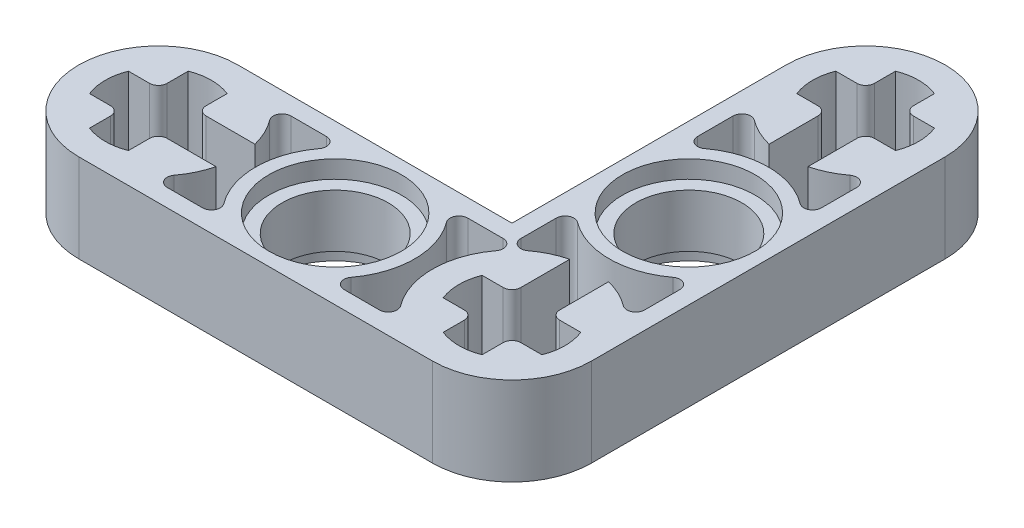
from build123d import *

# Parameters (mm, degrees)
BOSS_EXTRUDE1_DEPTH      = 2
BOSS_EXTRUDE1_DEPTH_BACK = 2
SKETCH2_R                = 2.4
SKETCH3_R                = 3
CUT_EXTRUDE1_DEPTH       = 0.8


with BuildPart() as part:
    # Sketch2 → Boss-Extrude1 (new, two sides: drawn at the far end of the back side and taken through both)
    with BuildSketch(Plane(origin=(0, 0, 0), x_dir=(1, 0, 0), z_dir=(0, 1, 0)).offset(-BOSS_EXTRUDE1_DEPTH_BACK)):
        with BuildLine():
            Line((-16, 3.6), (-3.6, 3.6))
            Line((-3.6, 3.6), (-3.6, 16))
            ThreePointArc((-3.6, 16), (0, 19.6), (3.6, 16))
            Line((3.6, 16), (3.6, 0))
            ThreePointArc((3.6, 0), (2.545584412, -2.545584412), (0, -3.6))
            Line((0, -3.6), (-16, -3.6))
            ThreePointArc((-16, -3.6), (-19.6, 0), (-16, 3.6))
        make_face()
        with Locations(Location((0, 8, 0), (0, 0, 270))):
            Circle(SKETCH2_R, mode=Mode.SUBTRACT)
        with Locations(Location((-8, 0, 0), (0, 0, 270))):
            Circle(SKETCH2_R, mode=Mode.SUBTRACT)
        with BuildLine():
            Line((-0.88, 2.232845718), (-0.88, 1.28))
            ThreePointArc((-0.88, 1.28), (-0.997157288, 0.997157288), (-1.28, 0.88))
            Line((-1.28, 0.88), (-2.232845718, 0.88))
            ThreePointArc((-2.232845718, 0.88), (-2.4, 0), (-2.232845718, -0.88))
            Line((-2.232845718, -0.88), (-1.28, -0.88))
            ThreePointArc((-1.28, -0.88), (-0.997157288, -0.997157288), (-0.88, -1.28))
            Line((-0.88, -1.28), (-0.88, -2.232845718))
            ThreePointArc((-0.88, -2.232845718), (0, -2.4), (0.88, -2.232845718))
            Line((0.88, -2.232845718), (0.88, -1.28))
            ThreePointArc((0.88, -1.28), (0.997157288, -0.997157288), (1.28, -0.88))
            Line((1.28, -0.88), (2.232845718, -0.88))
            ThreePointArc((2.232845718, -0.88), (2.4, 0), (2.232845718, 0.88))
            Line((2.232845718, 0.88), (1.28, 0.88))
            ThreePointArc((1.28, 0.88), (0.997157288, 0.997157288), (0.88, 1.28))
            Line((0.88, 1.28), (0.88, 2.232845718))
            Line((0.88, 2.232845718), (0.88, 3.490787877))
            ThreePointArc((0.88, 3.490787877), (1.550375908, 3.24905133), (2.16, 2.88))
            ThreePointArc((2.16, 2.88), (2.578885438, 2.842229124), (2.8, 3.2))
            Line((2.8, 3.2), (2.8, 4.8))
            ThreePointArc((2.8, 4.8), (2.578885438, 5.157770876), (2.16, 5.12))
            ThreePointArc((2.16, 5.12), (0, 4.4), (-2.16, 5.12))
            ThreePointArc((-2.16, 5.12), (-2.578885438, 5.157770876), (-2.8, 4.8))
            Line((-2.8, 4.8), (-2.8, 3.2))
            ThreePointArc((-2.8, 3.2), (-2.578885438, 2.842229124), (-2.16, 2.88))
            ThreePointArc((-2.16, 2.88), (-1.550375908, 3.24905133), (-0.88, 3.490787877))
            Line((-0.88, 3.490787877), (-0.88, 2.232845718))
        make_face(mode=Mode.SUBTRACT)
        with BuildLine():
            Line((-18.232845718, -0.88), (-17.28, -0.88))
            ThreePointArc((-17.28, -0.88), (-16.997157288, -0.997157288), (-16.88, -1.28))
            Line((-16.88, -1.28), (-16.88, -2.232845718))
            ThreePointArc((-16.88, -2.232845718), (-16, -2.4), (-15.12, -2.232845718))
            Line((-15.12, -2.232845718), (-15.12, -1.28))
            ThreePointArc((-15.12, -1.28), (-15.002842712, -0.997157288), (-14.72, -0.88))
            Line((-14.72, -0.88), (-13.767154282, -0.88))
            Line((-13.767154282, -0.88), (-12.509212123, -0.88))
            ThreePointArc((-12.509212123, -0.88), (-12.75094867, -1.550375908), (-13.12, -2.16))
            ThreePointArc((-13.12, -2.16), (-13.157770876, -2.578885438), (-12.8, -2.8))
            Line((-12.8, -2.8), (-11.2, -2.8))
            ThreePointArc((-11.2, -2.8), (-10.842229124, -2.578885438), (-10.88, -2.16))
            ThreePointArc((-10.88, -2.16), (-11.6, 0), (-10.88, 2.16))
            ThreePointArc((-10.88, 2.16), (-10.842229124, 2.578885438), (-11.2, 2.8))
            Line((-11.2, 2.8), (-12.8, 2.8))
            ThreePointArc((-12.8, 2.8), (-13.157770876, 2.578885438), (-13.12, 2.16))
            ThreePointArc((-13.12, 2.16), (-12.75094867, 1.550375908), (-12.509212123, 0.88))
            Line((-12.509212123, 0.88), (-13.767154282, 0.88))
            Line((-13.767154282, 0.88), (-14.72, 0.88))
            ThreePointArc((-14.72, 0.88), (-15.002842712, 0.997157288), (-15.12, 1.28))
            Line((-15.12, 1.28), (-15.12, 2.232845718))
            ThreePointArc((-15.12, 2.232845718), (-16, 2.4), (-16.88, 2.232845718))
            Line((-16.88, 2.232845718), (-16.88, 1.28))
            ThreePointArc((-16.88, 1.28), (-16.997157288, 0.997157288), (-17.28, 0.88))
            Line((-17.28, 0.88), (-18.232845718, 0.88))
            ThreePointArc((-18.232845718, 0.88), (-18.4, 0), (-18.232845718, -0.88))
        make_face(mode=Mode.SUBTRACT)
        with BuildLine():
            Line((-2.232845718, 15.12), (-1.28, 15.12))
            ThreePointArc((-1.28, 15.12), (-0.997157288, 15.002842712), (-0.88, 14.72))
            Line((-0.88, 14.72), (-0.88, 13.767154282))
            Line((-0.88, 13.767154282), (-0.88, 12.509212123))
            ThreePointArc((-0.88, 12.509212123), (-1.550375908, 12.75094867), (-2.16, 13.12))
            ThreePointArc((-2.16, 13.12), (-2.578885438, 13.157770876), (-2.8, 12.8))
            Line((-2.8, 12.8), (-2.8, 11.2))
            ThreePointArc((-2.8, 11.2), (-2.578885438, 10.842229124), (-2.16, 10.88))
            ThreePointArc((-2.16, 10.88), (0, 11.6), (2.16, 10.88))
            ThreePointArc((2.16, 10.88), (2.578885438, 10.842229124), (2.8, 11.2))
            Line((2.8, 11.2), (2.8, 12.8))
            ThreePointArc((2.8, 12.8), (2.578885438, 13.157770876), (2.16, 13.12))
            ThreePointArc((2.16, 13.12), (1.550375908, 12.75094867), (0.88, 12.509212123))
            Line((0.88, 12.509212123), (0.88, 13.767154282))
            Line((0.88, 13.767154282), (0.88, 14.72))
            ThreePointArc((0.88, 14.72), (0.997157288, 15.002842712), (1.28, 15.12))
            Line((1.28, 15.12), (2.232845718, 15.12))
            ThreePointArc((2.232845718, 15.12), (2.4, 16), (2.232845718, 16.88))
            Line((2.232845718, 16.88), (1.28, 16.88))
            ThreePointArc((1.28, 16.88), (0.997157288, 16.997157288), (0.88, 17.28))
            Line((0.88, 17.28), (0.88, 18.232845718))
            ThreePointArc((0.88, 18.232845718), (0, 18.4), (-0.88, 18.232845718))
            Line((-0.88, 18.232845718), (-0.88, 17.28))
            ThreePointArc((-0.88, 17.28), (-0.997157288, 16.997157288), (-1.28, 16.88))
            Line((-1.28, 16.88), (-2.232845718, 16.88))
            ThreePointArc((-2.232845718, 16.88), (-2.4, 16), (-2.232845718, 15.12))
        make_face(mode=Mode.SUBTRACT)
        with BuildLine():
            Line((-3.2, -2.8), (-4.8, -2.8))
            ThreePointArc((-4.8, -2.8), (-5.157770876, -2.578885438), (-5.12, -2.16))
            ThreePointArc((-5.12, -2.16), (-4.4, 0), (-5.12, 2.16))
            ThreePointArc((-5.12, 2.16), (-5.157770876, 2.578885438), (-4.8, 2.8))
            Line((-4.8, 2.8), (-3.2, 2.8))
            ThreePointArc((-3.2, 2.8), (-2.842229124, 2.578885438), (-2.88, 2.16))
            ThreePointArc((-2.88, 2.16), (-3.6, 0), (-2.88, -2.16))
            ThreePointArc((-2.88, -2.16), (-2.842229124, -2.578885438), (-3.2, -2.8))
        make_face(mode=Mode.SUBTRACT)
    extrude(amount=BOSS_EXTRUDE1_DEPTH + BOSS_EXTRUDE1_DEPTH_BACK)

    # Sketch3 → Cut-Extrude1 (cut)
    with BuildSketch(Plane(origin=(0, 2, 0), x_dir=(1, 0, 0), z_dir=(0, 1, 0))):
        with Locations(Location((-8, 0, 0), (0, 0, 270))):
            Circle(SKETCH3_R)
        with Locations(Location((0, 8, 0), (0, 0, 270))):
            Circle(SKETCH3_R)
    cut_extrude1 = extrude(amount=-CUT_EXTRUDE1_DEPTH, mode=Mode.SUBTRACT)

    # Mirror1: Cut-Extrude1 across plane
    add(cut_extrude1.mirror(Plane.ZX), mode=Mode.SUBTRACT)


solid = part.part
